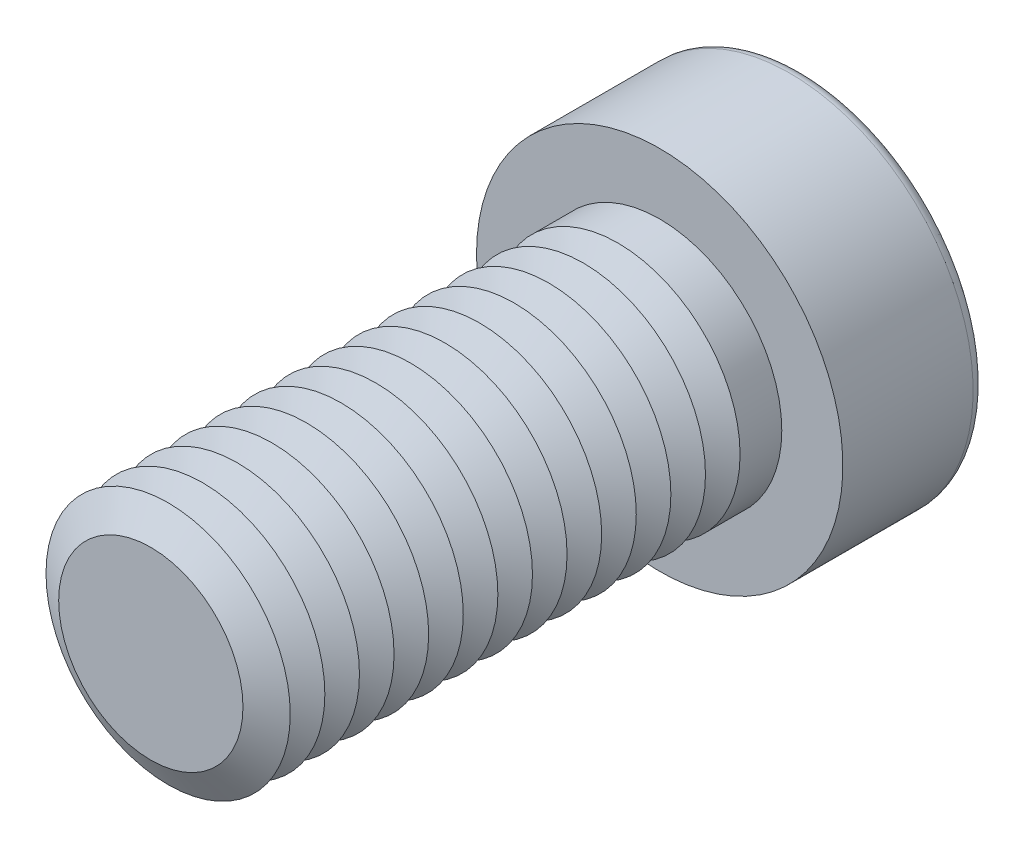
ISO-10303-21;
HEADER;
FILE_DESCRIPTION(('STEP AP214'),'2;1');
FILE_NAME('part.step','',(''),(''),'','','');
FILE_SCHEMA(('AUTOMOTIVE_DESIGN { 1 0 10303 214 1 1 1 1 }'));
ENDSEC;
DATA;
#1=APPLICATION_CONTEXT('core data for automotive mechanical design processes');
#2=APPLICATION_PROTOCOL_DEFINITION('international standard','automotive_design',2000,#1);
#3=PRODUCT_CONTEXT('',#1,'mechanical');
#4=PRODUCT('Part','Part','',(#3));
#5=PRODUCT_RELATED_PRODUCT_CATEGORY('part','',(#4));
#6=PRODUCT_DEFINITION_FORMATION('','',#4);
#7=PRODUCT_DEFINITION_CONTEXT('part definition',#1,'design');
#8=PRODUCT_DEFINITION('design','',#6,#7);
#9=PRODUCT_DEFINITION_SHAPE('','',#8);
#10=(LENGTH_UNIT() NAMED_UNIT(*) SI_UNIT(.MILLI.,.METRE.));
#11=(NAMED_UNIT(*) PLANE_ANGLE_UNIT() SI_UNIT($,.RADIAN.));
#12=(NAMED_UNIT(*) SI_UNIT($,.STERADIAN.) SOLID_ANGLE_UNIT());
#13=UNCERTAINTY_MEASURE_WITH_UNIT(LENGTH_MEASURE(1.E-05),#10,'distance_accuracy_value','');
#14=(GEOMETRIC_REPRESENTATION_CONTEXT(3) GLOBAL_UNCERTAINTY_ASSIGNED_CONTEXT((#13)) GLOBAL_UNIT_ASSIGNED_CONTEXT((#10,
#11,#12)) REPRESENTATION_CONTEXT('',''));
#15=CARTESIAN_POINT('',(0.,0.,0.));
#16=DIRECTION('',(0.,0.,1.));
#17=DIRECTION('',(1.,0.,0.));
#18=AXIS2_PLACEMENT_3D('',#15,#16,#17);
#19=CARTESIAN_POINT('',(0.,0.,19.05));
#20=DIRECTION('',(0.,0.,1.));
#21=DIRECTION('',(1.,0.,0.));
#22=AXIS2_PLACEMENT_3D('',#19,#20,#21);
#23=CONICAL_SURFACE('',#22,6.,1.0471975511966);
#24=CARTESIAN_POINT('',(0.,0.,18.2));
#25=DIRECTION('',(0.,0.,1.));
#26=DIRECTION('',(1.,0.,0.));
#27=AXIS2_PLACEMENT_3D('',#24,#25,#26);
#28=CIRCLE('',#27,4.52775681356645);
#29=CARTESIAN_POINT('',(4.52775681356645,0.,18.2));
#30=VERTEX_POINT('',#29);
#31=EDGE_CURVE('E312',#30,#30,#28,.T.);
#32=ORIENTED_EDGE('',*,*,#31,.T.);
#33=EDGE_LOOP('',(#32));
#34=FACE_BOUND('',#33,.T.);
#35=CARTESIAN_POINT('',(0.,0.,19.05));
#36=DIRECTION('',(0.,0.,1.));
#37=DIRECTION('',(1.,0.,0.));
#38=AXIS2_PLACEMENT_3D('',#35,#36,#37);
#39=CIRCLE('',#38,6.);
#40=CARTESIAN_POINT('',(6.,0.,19.05));
#41=VERTEX_POINT('',#40);
#42=EDGE_CURVE('E315',#41,#41,#39,.T.);
#43=ORIENTED_EDGE('',*,*,#42,.F.);
#44=EDGE_LOOP('',(#43));
#45=FACE_BOUND('',#44,.T.);
#46=ADVANCED_FACE('F39',(#34,#45),#23,.T.);
#47=CARTESIAN_POINT('',(0.,0.,18.2));
#48=DIRECTION('',(0.,0.,-1.));
#49=DIRECTION('',(-1.,0.,0.));
#50=AXIS2_PLACEMENT_3D('',#47,#48,#49);
#51=CONICAL_SURFACE('',#50,4.52775681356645,1.0471975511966);
#52=CARTESIAN_POINT('',(0.,0.,17.35));
#53=DIRECTION('',(0.,0.,1.));
#54=DIRECTION('',(1.,0.,0.));
#55=AXIS2_PLACEMENT_3D('',#52,#53,#54);
#56=CIRCLE('',#55,6.);
#57=CARTESIAN_POINT('',(6.,0.,17.35));
#58=VERTEX_POINT('',#57);
#59=EDGE_CURVE('E323',#58,#58,#56,.T.);
#60=ORIENTED_EDGE('',*,*,#59,.T.);
#61=EDGE_LOOP('',(#60));
#62=FACE_BOUND('',#61,.T.);
#63=ORIENTED_EDGE('',*,*,#31,.F.);
#64=EDGE_LOOP('',(#63));
#65=FACE_BOUND('',#64,.T.);
#66=ADVANCED_FACE('F244',(#62,#65),#51,.T.);
#67=CARTESIAN_POINT('',(0.,0.,25.));
#68=DIRECTION('',(0.,0.,1.));
#69=DIRECTION('',(1.,0.,0.));
#70=AXIS2_PLACEMENT_3D('',#67,#68,#69);
#71=PLANE('',#70);
#72=CARTESIAN_POINT('',(0.,0.,25.));
#73=DIRECTION('',(0.,0.,1.));
#74=DIRECTION('',(1.,0.,0.));
#75=AXIS2_PLACEMENT_3D('',#72,#73,#74);
#76=CIRCLE('',#75,4.52775681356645);
#77=CARTESIAN_POINT('',(4.52775681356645,0.,25.));
#78=VERTEX_POINT('',#77);
#79=EDGE_CURVE('E173',#78,#78,#76,.T.);
#80=ORIENTED_EDGE('',*,*,#79,.T.);
#81=EDGE_LOOP('',(#80));
#82=FACE_BOUND('',#81,.T.);
#83=ADVANCED_FACE('F250',(#82),#71,.T.);
#84=CARTESIAN_POINT('',(0.,0.,25.));
#85=DIRECTION('',(0.,0.,-1.));
#86=DIRECTION('',(-1.,0.,0.));
#87=AXIS2_PLACEMENT_3D('',#84,#85,#86);
#88=CONICAL_SURFACE('',#87,4.52775681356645,1.0471975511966);
#89=CARTESIAN_POINT('',(0.,0.,24.15));
#90=DIRECTION('',(0.,0.,1.));
#91=DIRECTION('',(1.,0.,0.));
#92=AXIS2_PLACEMENT_3D('',#89,#90,#91);
#93=CIRCLE('',#92,6.);
#94=CARTESIAN_POINT('',(6.,0.,24.15));
#95=VERTEX_POINT('',#94);
#96=EDGE_CURVE('E290',#95,#95,#93,.T.);
#97=ORIENTED_EDGE('',*,*,#96,.T.);
#98=EDGE_LOOP('',(#97));
#99=FACE_BOUND('',#98,.T.);
#100=ORIENTED_EDGE('',*,*,#79,.F.);
#101=EDGE_LOOP('',(#100));
#102=FACE_BOUND('',#101,.T.);
#103=ADVANCED_FACE('F198',(#99,#102),#88,.T.);
#104=CARTESIAN_POINT('',(0.,0.,24.15));
#105=DIRECTION('',(0.,0.,1.));
#106=DIRECTION('',(1.,0.,0.));
#107=AXIS2_PLACEMENT_3D('',#104,#105,#106);
#108=CONICAL_SURFACE('',#107,6.,1.0471975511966);
#109=CARTESIAN_POINT('',(0.,0.,23.3));
#110=DIRECTION('',(0.,0.,1.));
#111=DIRECTION('',(1.,0.,0.));
#112=AXIS2_PLACEMENT_3D('',#109,#110,#111);
#113=CIRCLE('',#112,4.52775681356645);
#114=CARTESIAN_POINT('',(4.52775681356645,0.,23.3));
#115=VERTEX_POINT('',#114);
#116=EDGE_CURVE('E287',#115,#115,#113,.T.);
#117=ORIENTED_EDGE('',*,*,#116,.T.);
#118=EDGE_LOOP('',(#117));
#119=FACE_BOUND('',#118,.T.);
#120=ORIENTED_EDGE('',*,*,#96,.F.);
#121=EDGE_LOOP('',(#120));
#122=FACE_BOUND('',#121,.T.);
#123=ADVANCED_FACE('F276',(#119,#122),#108,.T.);
#124=CARTESIAN_POINT('',(0.,0.,23.3));
#125=DIRECTION('',(0.,0.,-1.));
#126=DIRECTION('',(-1.,0.,0.));
#127=AXIS2_PLACEMENT_3D('',#124,#125,#126);
#128=CONICAL_SURFACE('',#127,4.52775681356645,1.0471975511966);
#129=CARTESIAN_POINT('',(0.,0.,22.45));
#130=DIRECTION('',(0.,0.,1.));
#131=DIRECTION('',(1.,0.,0.));
#132=AXIS2_PLACEMENT_3D('',#129,#130,#131);
#133=CIRCLE('',#132,6.);
#134=CARTESIAN_POINT('',(6.,0.,22.45));
#135=VERTEX_POINT('',#134);
#136=EDGE_CURVE('E298',#135,#135,#133,.T.);
#137=ORIENTED_EDGE('',*,*,#136,.T.);
#138=EDGE_LOOP('',(#137));
#139=FACE_BOUND('',#138,.T.);
#140=ORIENTED_EDGE('',*,*,#116,.F.);
#141=EDGE_LOOP('',(#140));
#142=FACE_BOUND('',#141,.T.);
#143=ADVANCED_FACE('F273',(#139,#142),#128,.T.);
#144=CARTESIAN_POINT('',(0.,0.,22.45));
#145=DIRECTION('',(0.,0.,1.));
#146=DIRECTION('',(1.,0.,0.));
#147=AXIS2_PLACEMENT_3D('',#144,#145,#146);
#148=CONICAL_SURFACE('',#147,6.,1.0471975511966);
#149=CARTESIAN_POINT('',(0.,0.,21.6));
#150=DIRECTION('',(0.,0.,1.));
#151=DIRECTION('',(1.,0.,0.));
#152=AXIS2_PLACEMENT_3D('',#149,#150,#151);
#153=CIRCLE('',#152,4.52775681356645);
#154=CARTESIAN_POINT('',(4.52775681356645,0.,21.6));
#155=VERTEX_POINT('',#154);
#156=EDGE_CURVE('E292',#155,#155,#153,.T.);
#157=ORIENTED_EDGE('',*,*,#156,.T.);
#158=EDGE_LOOP('',(#157));
#159=FACE_BOUND('',#158,.T.);
#160=ORIENTED_EDGE('',*,*,#136,.F.);
#161=EDGE_LOOP('',(#160));
#162=FACE_BOUND('',#161,.T.);
#163=ADVANCED_FACE('F269',(#159,#162),#148,.T.);
#164=CARTESIAN_POINT('',(0.,0.,21.6));
#165=DIRECTION('',(0.,0.,-1.));
#166=DIRECTION('',(-1.,0.,0.));
#167=AXIS2_PLACEMENT_3D('',#164,#165,#166);
#168=CONICAL_SURFACE('',#167,4.52775681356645,1.0471975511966);
#169=CARTESIAN_POINT('',(0.,0.,20.75));
#170=DIRECTION('',(0.,0.,1.));
#171=DIRECTION('',(1.,0.,0.));
#172=AXIS2_PLACEMENT_3D('',#169,#170,#171);
#173=CIRCLE('',#172,6.);
#174=CARTESIAN_POINT('',(6.,0.,20.75));
#175=VERTEX_POINT('',#174);
#176=EDGE_CURVE('E308',#175,#175,#173,.T.);
#177=ORIENTED_EDGE('',*,*,#176,.T.);
#178=EDGE_LOOP('',(#177));
#179=FACE_BOUND('',#178,.T.);
#180=ORIENTED_EDGE('',*,*,#156,.F.);
#181=EDGE_LOOP('',(#180));
#182=FACE_BOUND('',#181,.T.);
#183=ADVANCED_FACE('F265',(#179,#182),#168,.T.);
#184=CARTESIAN_POINT('',(0.,0.,20.75));
#185=DIRECTION('',(0.,0.,1.));
#186=DIRECTION('',(1.,0.,0.));
#187=AXIS2_PLACEMENT_3D('',#184,#185,#186);
#188=CONICAL_SURFACE('',#187,6.,1.0471975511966);
#189=CARTESIAN_POINT('',(0.,0.,19.9));
#190=DIRECTION('',(0.,0.,1.));
#191=DIRECTION('',(1.,0.,0.));
#192=AXIS2_PLACEMENT_3D('',#189,#190,#191);
#193=CIRCLE('',#192,4.52775681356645);
#194=CARTESIAN_POINT('',(4.52775681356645,0.,19.9));
#195=VERTEX_POINT('',#194);
#196=EDGE_CURVE('E304',#195,#195,#193,.T.);
#197=ORIENTED_EDGE('',*,*,#196,.T.);
#198=EDGE_LOOP('',(#197));
#199=FACE_BOUND('',#198,.T.);
#200=ORIENTED_EDGE('',*,*,#176,.F.);
#201=EDGE_LOOP('',(#200));
#202=FACE_BOUND('',#201,.T.);
#203=ADVANCED_FACE('F261',(#199,#202),#188,.T.);
#204=CARTESIAN_POINT('',(0.,0.,19.9));
#205=DIRECTION('',(0.,0.,-1.));
#206=DIRECTION('',(-1.,0.,0.));
#207=AXIS2_PLACEMENT_3D('',#204,#205,#206);
#208=CONICAL_SURFACE('',#207,4.52775681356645,1.0471975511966);
#209=ORIENTED_EDGE('',*,*,#42,.T.);
#210=EDGE_LOOP('',(#209));
#211=FACE_BOUND('',#210,.T.);
#212=ORIENTED_EDGE('',*,*,#196,.F.);
#213=EDGE_LOOP('',(#212));
#214=FACE_BOUND('',#213,.T.);
#215=ADVANCED_FACE('F257',(#211,#214),#208,.T.);
#216=CARTESIAN_POINT('',(0.,0.,17.35));
#217=DIRECTION('',(0.,0.,1.));
#218=DIRECTION('',(1.,0.,0.));
#219=AXIS2_PLACEMENT_3D('',#216,#217,#218);
#220=CONICAL_SURFACE('',#219,6.,1.0471975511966);
#221=CARTESIAN_POINT('',(0.,0.,16.5));
#222=DIRECTION('',(0.,0.,1.));
#223=DIRECTION('',(1.,0.,0.));
#224=AXIS2_PLACEMENT_3D('',#221,#222,#223);
#225=CIRCLE('',#224,4.52775681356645);
#226=CARTESIAN_POINT('',(4.52775681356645,0.,16.5));
#227=VERTEX_POINT('',#226);
#228=EDGE_CURVE('E319',#227,#227,#225,.T.);
#229=ORIENTED_EDGE('',*,*,#228,.T.);
#230=EDGE_LOOP('',(#229));
#231=FACE_BOUND('',#230,.T.);
#232=ORIENTED_EDGE('',*,*,#59,.F.);
#233=EDGE_LOOP('',(#232));
#234=FACE_BOUND('',#233,.T.);
#235=ADVANCED_FACE('F260',(#231,#234),#220,.T.);
#236=CARTESIAN_POINT('',(0.,0.,16.5));
#237=DIRECTION('',(0.,0.,-1.));
#238=DIRECTION('',(-1.,0.,0.));
#239=AXIS2_PLACEMENT_3D('',#236,#237,#238);
#240=CONICAL_SURFACE('',#239,4.52775681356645,1.0471975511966);
#241=CARTESIAN_POINT('',(0.,0.,15.65));
#242=DIRECTION('',(0.,0.,1.));
#243=DIRECTION('',(1.,0.,0.));
#244=AXIS2_PLACEMENT_3D('',#241,#242,#243);
#245=CIRCLE('',#244,6.);
#246=CARTESIAN_POINT('',(6.,0.,15.65));
#247=VERTEX_POINT('',#246);
#248=EDGE_CURVE('E330',#247,#247,#245,.T.);
#249=ORIENTED_EDGE('',*,*,#248,.T.);
#250=EDGE_LOOP('',(#249));
#251=FACE_BOUND('',#250,.T.);
#252=ORIENTED_EDGE('',*,*,#228,.F.);
#253=EDGE_LOOP('',(#252));
#254=FACE_BOUND('',#253,.T.);
#255=ADVANCED_FACE('F463',(#251,#254),#240,.T.);
#256=CARTESIAN_POINT('',(0.,0.,15.65));
#257=DIRECTION('',(0.,0.,1.));
#258=DIRECTION('',(1.,0.,0.));
#259=AXIS2_PLACEMENT_3D('',#256,#257,#258);
#260=CONICAL_SURFACE('',#259,6.,1.0471975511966);
#261=CARTESIAN_POINT('',(0.,0.,14.8));
#262=DIRECTION('',(0.,0.,1.));
#263=DIRECTION('',(1.,0.,0.));
#264=AXIS2_PLACEMENT_3D('',#261,#262,#263);
#265=CIRCLE('',#264,4.52775681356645);
#266=CARTESIAN_POINT('',(4.52775681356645,0.,14.8));
#267=VERTEX_POINT('',#266);
#268=EDGE_CURVE('E326',#267,#267,#265,.T.);
#269=ORIENTED_EDGE('',*,*,#268,.T.);
#270=EDGE_LOOP('',(#269));
#271=FACE_BOUND('',#270,.T.);
#272=ORIENTED_EDGE('',*,*,#248,.F.);
#273=EDGE_LOOP('',(#272));
#274=FACE_BOUND('',#273,.T.);
#275=ADVANCED_FACE('F459',(#271,#274),#260,.T.);
#276=CARTESIAN_POINT('',(0.,0.,14.8));
#277=DIRECTION('',(0.,0.,-1.));
#278=DIRECTION('',(-1.,0.,0.));
#279=AXIS2_PLACEMENT_3D('',#276,#277,#278);
#280=CONICAL_SURFACE('',#279,4.52775681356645,1.0471975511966);
#281=CARTESIAN_POINT('',(0.,0.,13.95));
#282=DIRECTION('',(0.,0.,1.));
#283=DIRECTION('',(1.,0.,0.));
#284=AXIS2_PLACEMENT_3D('',#281,#282,#283);
#285=CIRCLE('',#284,6.);
#286=CARTESIAN_POINT('',(6.,0.,13.95));
#287=VERTEX_POINT('',#286);
#288=EDGE_CURVE('E338',#287,#287,#285,.T.);
#289=ORIENTED_EDGE('',*,*,#288,.T.);
#290=EDGE_LOOP('',(#289));
#291=FACE_BOUND('',#290,.T.);
#292=ORIENTED_EDGE('',*,*,#268,.F.);
#293=EDGE_LOOP('',(#292));
#294=FACE_BOUND('',#293,.T.);
#295=ADVANCED_FACE('F455',(#291,#294),#280,.T.);
#296=CARTESIAN_POINT('',(0.,0.,13.95));
#297=DIRECTION('',(0.,0.,1.));
#298=DIRECTION('',(1.,0.,0.));
#299=AXIS2_PLACEMENT_3D('',#296,#297,#298);
#300=CONICAL_SURFACE('',#299,6.,1.0471975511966);
#301=CARTESIAN_POINT('',(0.,0.,13.1));
#302=DIRECTION('',(0.,0.,1.));
#303=DIRECTION('',(1.,0.,0.));
#304=AXIS2_PLACEMENT_3D('',#301,#302,#303);
#305=CIRCLE('',#304,4.52775681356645);
#306=CARTESIAN_POINT('',(4.52775681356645,0.,13.1));
#307=VERTEX_POINT('',#306);
#308=EDGE_CURVE('E334',#307,#307,#305,.T.);
#309=ORIENTED_EDGE('',*,*,#308,.T.);
#310=EDGE_LOOP('',(#309));
#311=FACE_BOUND('',#310,.T.);
#312=ORIENTED_EDGE('',*,*,#288,.F.);
#313=EDGE_LOOP('',(#312));
#314=FACE_BOUND('',#313,.T.);
#315=ADVANCED_FACE('F451',(#311,#314),#300,.T.);
#316=CARTESIAN_POINT('',(0.,0.,13.1));
#317=DIRECTION('',(0.,0.,-1.));
#318=DIRECTION('',(-1.,0.,0.));
#319=AXIS2_PLACEMENT_3D('',#316,#317,#318);
#320=CONICAL_SURFACE('',#319,4.52775681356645,1.0471975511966);
#321=CARTESIAN_POINT('',(0.,0.,12.25));
#322=DIRECTION('',(0.,0.,1.));
#323=DIRECTION('',(1.,0.,0.));
#324=AXIS2_PLACEMENT_3D('',#321,#322,#323);
#325=CIRCLE('',#324,6.);
#326=CARTESIAN_POINT('',(6.,0.,12.25));
#327=VERTEX_POINT('',#326);
#328=EDGE_CURVE('E346',#327,#327,#325,.T.);
#329=ORIENTED_EDGE('',*,*,#328,.T.);
#330=EDGE_LOOP('',(#329));
#331=FACE_BOUND('',#330,.T.);
#332=ORIENTED_EDGE('',*,*,#308,.F.);
#333=EDGE_LOOP('',(#332));
#334=FACE_BOUND('',#333,.T.);
#335=ADVANCED_FACE('F447',(#331,#334),#320,.T.);
#336=CARTESIAN_POINT('',(0.,0.,12.25));
#337=DIRECTION('',(0.,0.,1.));
#338=DIRECTION('',(1.,0.,0.));
#339=AXIS2_PLACEMENT_3D('',#336,#337,#338);
#340=CONICAL_SURFACE('',#339,6.,1.0471975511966);
#341=CARTESIAN_POINT('',(0.,0.,11.4));
#342=DIRECTION('',(0.,0.,1.));
#343=DIRECTION('',(1.,0.,0.));
#344=AXIS2_PLACEMENT_3D('',#341,#342,#343);
#345=CIRCLE('',#344,4.52775681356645);
#346=CARTESIAN_POINT('',(4.52775681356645,0.,11.4));
#347=VERTEX_POINT('',#346);
#348=EDGE_CURVE('E342',#347,#347,#345,.T.);
#349=ORIENTED_EDGE('',*,*,#348,.T.);
#350=EDGE_LOOP('',(#349));
#351=FACE_BOUND('',#350,.T.);
#352=ORIENTED_EDGE('',*,*,#328,.F.);
#353=EDGE_LOOP('',(#352));
#354=FACE_BOUND('',#353,.T.);
#355=ADVANCED_FACE('F443',(#351,#354),#340,.T.);
#356=CARTESIAN_POINT('',(0.,0.,11.4));
#357=DIRECTION('',(0.,0.,-1.));
#358=DIRECTION('',(-1.,0.,0.));
#359=AXIS2_PLACEMENT_3D('',#356,#357,#358);
#360=CONICAL_SURFACE('',#359,4.52775681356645,1.0471975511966);
#361=CARTESIAN_POINT('',(0.,0.,10.55));
#362=DIRECTION('',(0.,0.,1.));
#363=DIRECTION('',(1.,0.,0.));
#364=AXIS2_PLACEMENT_3D('',#361,#362,#363);
#365=CIRCLE('',#364,6.);
#366=CARTESIAN_POINT('',(6.,0.,10.55));
#367=VERTEX_POINT('',#366);
#368=EDGE_CURVE('E354',#367,#367,#365,.T.);
#369=ORIENTED_EDGE('',*,*,#368,.T.);
#370=EDGE_LOOP('',(#369));
#371=FACE_BOUND('',#370,.T.);
#372=ORIENTED_EDGE('',*,*,#348,.F.);
#373=EDGE_LOOP('',(#372));
#374=FACE_BOUND('',#373,.T.);
#375=ADVANCED_FACE('F439',(#371,#374),#360,.T.);
#376=CARTESIAN_POINT('',(0.,0.,10.55));
#377=DIRECTION('',(0.,0.,1.));
#378=DIRECTION('',(1.,0.,0.));
#379=AXIS2_PLACEMENT_3D('',#376,#377,#378);
#380=CONICAL_SURFACE('',#379,6.,1.0471975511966);
#381=CARTESIAN_POINT('',(0.,0.,9.7));
#382=DIRECTION('',(0.,0.,1.));
#383=DIRECTION('',(1.,0.,0.));
#384=AXIS2_PLACEMENT_3D('',#381,#382,#383);
#385=CIRCLE('',#384,4.52775681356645);
#386=CARTESIAN_POINT('',(4.52775681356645,0.,9.7));
#387=VERTEX_POINT('',#386);
#388=EDGE_CURVE('E350',#387,#387,#385,.T.);
#389=ORIENTED_EDGE('',*,*,#388,.T.);
#390=EDGE_LOOP('',(#389));
#391=FACE_BOUND('',#390,.T.);
#392=ORIENTED_EDGE('',*,*,#368,.F.);
#393=EDGE_LOOP('',(#392));
#394=FACE_BOUND('',#393,.T.);
#395=ADVANCED_FACE('F435',(#391,#394),#380,.T.);
#396=CARTESIAN_POINT('',(0.,0.,9.7));
#397=DIRECTION('',(0.,0.,-1.));
#398=DIRECTION('',(-1.,0.,0.));
#399=AXIS2_PLACEMENT_3D('',#396,#397,#398);
#400=CONICAL_SURFACE('',#399,4.52775681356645,1.0471975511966);
#401=CARTESIAN_POINT('',(0.,0.,8.85));
#402=DIRECTION('',(0.,0.,1.));
#403=DIRECTION('',(1.,0.,0.));
#404=AXIS2_PLACEMENT_3D('',#401,#402,#403);
#405=CIRCLE('',#404,6.);
#406=CARTESIAN_POINT('',(6.,0.,8.85));
#407=VERTEX_POINT('',#406);
#408=EDGE_CURVE('E362',#407,#407,#405,.T.);
#409=ORIENTED_EDGE('',*,*,#408,.T.);
#410=EDGE_LOOP('',(#409));
#411=FACE_BOUND('',#410,.T.);
#412=ORIENTED_EDGE('',*,*,#388,.F.);
#413=EDGE_LOOP('',(#412));
#414=FACE_BOUND('',#413,.T.);
#415=ADVANCED_FACE('F431',(#411,#414),#400,.T.);
#416=CARTESIAN_POINT('',(0.,0.,8.85));
#417=DIRECTION('',(0.,0.,1.));
#418=DIRECTION('',(1.,0.,0.));
#419=AXIS2_PLACEMENT_3D('',#416,#417,#418);
#420=CONICAL_SURFACE('',#419,6.,1.0471975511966);
#421=CARTESIAN_POINT('',(0.,0.,8.));
#422=DIRECTION('',(0.,0.,1.));
#423=DIRECTION('',(1.,0.,0.));
#424=AXIS2_PLACEMENT_3D('',#421,#422,#423);
#425=CIRCLE('',#424,4.52775681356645);
#426=CARTESIAN_POINT('',(4.52775681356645,0.,8.));
#427=VERTEX_POINT('',#426);
#428=EDGE_CURVE('E358',#427,#427,#425,.T.);
#429=ORIENTED_EDGE('',*,*,#428,.T.);
#430=EDGE_LOOP('',(#429));
#431=FACE_BOUND('',#430,.T.);
#432=ORIENTED_EDGE('',*,*,#408,.F.);
#433=EDGE_LOOP('',(#432));
#434=FACE_BOUND('',#433,.T.);
#435=ADVANCED_FACE('F427',(#431,#434),#420,.T.);
#436=CARTESIAN_POINT('',(0.,0.,8.));
#437=DIRECTION('',(0.,0.,-1.));
#438=DIRECTION('',(-1.,0.,0.));
#439=AXIS2_PLACEMENT_3D('',#436,#437,#438);
#440=CONICAL_SURFACE('',#439,4.52775681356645,1.0471975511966);
#441=CARTESIAN_POINT('',(0.,0.,7.15));
#442=DIRECTION('',(0.,0.,1.));
#443=DIRECTION('',(1.,0.,0.));
#444=AXIS2_PLACEMENT_3D('',#441,#442,#443);
#445=CIRCLE('',#444,6.);
#446=CARTESIAN_POINT('',(6.,0.,7.15));
#447=VERTEX_POINT('',#446);
#448=EDGE_CURVE('E370',#447,#447,#445,.T.);
#449=ORIENTED_EDGE('',*,*,#448,.T.);
#450=EDGE_LOOP('',(#449));
#451=FACE_BOUND('',#450,.T.);
#452=ORIENTED_EDGE('',*,*,#428,.F.);
#453=EDGE_LOOP('',(#452));
#454=FACE_BOUND('',#453,.T.);
#455=ADVANCED_FACE('F423',(#451,#454),#440,.T.);
#456=CARTESIAN_POINT('',(0.,0.,7.15));
#457=DIRECTION('',(0.,0.,1.));
#458=DIRECTION('',(1.,0.,0.));
#459=AXIS2_PLACEMENT_3D('',#456,#457,#458);
#460=CONICAL_SURFACE('',#459,6.,1.0471975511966);
#461=CARTESIAN_POINT('',(0.,0.,6.3));
#462=DIRECTION('',(0.,0.,1.));
#463=DIRECTION('',(1.,0.,0.));
#464=AXIS2_PLACEMENT_3D('',#461,#462,#463);
#465=CIRCLE('',#464,4.52775681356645);
#466=CARTESIAN_POINT('',(4.52775681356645,0.,6.3));
#467=VERTEX_POINT('',#466);
#468=EDGE_CURVE('E366',#467,#467,#465,.T.);
#469=ORIENTED_EDGE('',*,*,#468,.T.);
#470=EDGE_LOOP('',(#469));
#471=FACE_BOUND('',#470,.T.);
#472=ORIENTED_EDGE('',*,*,#448,.F.);
#473=EDGE_LOOP('',(#472));
#474=FACE_BOUND('',#473,.T.);
#475=ADVANCED_FACE('F419',(#471,#474),#460,.T.);
#476=CARTESIAN_POINT('',(0.,0.,6.3));
#477=DIRECTION('',(0.,0.,-1.));
#478=DIRECTION('',(-1.,0.,0.));
#479=AXIS2_PLACEMENT_3D('',#476,#477,#478);
#480=CONICAL_SURFACE('',#479,4.52775681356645,1.0471975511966);
#481=CARTESIAN_POINT('',(0.,0.,5.45));
#482=DIRECTION('',(0.,0.,1.));
#483=DIRECTION('',(1.,0.,0.));
#484=AXIS2_PLACEMENT_3D('',#481,#482,#483);
#485=CIRCLE('',#484,6.);
#486=CARTESIAN_POINT('',(6.,0.,5.45));
#487=VERTEX_POINT('',#486);
#488=EDGE_CURVE('E378',#487,#487,#485,.T.);
#489=ORIENTED_EDGE('',*,*,#488,.T.);
#490=EDGE_LOOP('',(#489));
#491=FACE_BOUND('',#490,.T.);
#492=ORIENTED_EDGE('',*,*,#468,.F.);
#493=EDGE_LOOP('',(#492));
#494=FACE_BOUND('',#493,.T.);
#495=ADVANCED_FACE('F415',(#491,#494),#480,.T.);
#496=CARTESIAN_POINT('',(0.,0.,5.45));
#497=DIRECTION('',(0.,0.,1.));
#498=DIRECTION('',(1.,0.,0.));
#499=AXIS2_PLACEMENT_3D('',#496,#497,#498);
#500=CONICAL_SURFACE('',#499,6.,1.0471975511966);
#501=CARTESIAN_POINT('',(0.,0.,4.6));
#502=DIRECTION('',(0.,0.,1.));
#503=DIRECTION('',(1.,0.,0.));
#504=AXIS2_PLACEMENT_3D('',#501,#502,#503);
#505=CIRCLE('',#504,4.52775681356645);
#506=CARTESIAN_POINT('',(4.52775681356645,0.,4.6));
#507=VERTEX_POINT('',#506);
#508=EDGE_CURVE('E374',#507,#507,#505,.T.);
#509=ORIENTED_EDGE('',*,*,#508,.T.);
#510=EDGE_LOOP('',(#509));
#511=FACE_BOUND('',#510,.T.);
#512=ORIENTED_EDGE('',*,*,#488,.F.);
#513=EDGE_LOOP('',(#512));
#514=FACE_BOUND('',#513,.T.);
#515=ADVANCED_FACE('F410',(#511,#514),#500,.T.);
#516=CARTESIAN_POINT('',(0.,0.,4.6));
#517=DIRECTION('',(0.,0.,-1.));
#518=DIRECTION('',(-1.,0.,0.));
#519=AXIS2_PLACEMENT_3D('',#516,#517,#518);
#520=CONICAL_SURFACE('',#519,4.52775681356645,1.0471975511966);
#521=CARTESIAN_POINT('',(0.,0.,3.75));
#522=DIRECTION('',(0.,0.,1.));
#523=DIRECTION('',(1.,0.,0.));
#524=AXIS2_PLACEMENT_3D('',#521,#522,#523);
#525=CIRCLE('',#524,6.);
#526=CARTESIAN_POINT('',(6.,0.,3.75));
#527=VERTEX_POINT('',#526);
#528=EDGE_CURVE('E390',#527,#527,#525,.T.);
#529=ORIENTED_EDGE('',*,*,#528,.T.);
#530=EDGE_LOOP('',(#529));
#531=FACE_BOUND('',#530,.T.);
#532=ORIENTED_EDGE('',*,*,#508,.F.);
#533=EDGE_LOOP('',(#532));
#534=FACE_BOUND('',#533,.T.);
#535=ADVANCED_FACE('F396',(#531,#534),#520,.T.);
#536=CARTESIAN_POINT('',(0.,0.,3.75));
#537=DIRECTION('',(0.,0.,1.));
#538=DIRECTION('',(1.,0.,0.));
#539=AXIS2_PLACEMENT_3D('',#536,#537,#538);
#540=CONICAL_SURFACE('',#539,6.,1.0471975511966);
#541=CARTESIAN_POINT('',(0.,0.,2.9));
#542=DIRECTION('',(0.,0.,1.));
#543=DIRECTION('',(1.,0.,0.));
#544=AXIS2_PLACEMENT_3D('',#541,#542,#543);
#545=CIRCLE('',#544,4.52775681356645);
#546=CARTESIAN_POINT('',(4.52775681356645,0.,2.9));
#547=VERTEX_POINT('',#546);
#548=EDGE_CURVE('E382',#547,#547,#545,.T.);
#549=ORIENTED_EDGE('',*,*,#548,.T.);
#550=EDGE_LOOP('',(#549));
#551=FACE_BOUND('',#550,.T.);
#552=ORIENTED_EDGE('',*,*,#528,.F.);
#553=EDGE_LOOP('',(#552));
#554=FACE_BOUND('',#553,.T.);
#555=ADVANCED_FACE('F399',(#551,#554),#540,.T.);
#556=CARTESIAN_POINT('',(0.,0.,2.9));
#557=DIRECTION('',(0.,0.,-1.));
#558=DIRECTION('',(-1.,0.,0.));
#559=AXIS2_PLACEMENT_3D('',#556,#557,#558);
#560=CONICAL_SURFACE('',#559,4.52775681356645,1.0471975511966);
#561=CARTESIAN_POINT('',(0.,0.,2.05));
#562=DIRECTION('',(0.,0.,1.));
#563=DIRECTION('',(1.,0.,0.));
#564=AXIS2_PLACEMENT_3D('',#561,#562,#563);
#565=CIRCLE('',#564,6.);
#566=CARTESIAN_POINT('',(6.,0.,2.05));
#567=VERTEX_POINT('',#566);
#568=EDGE_CURVE('E386',#567,#567,#565,.T.);
#569=ORIENTED_EDGE('',*,*,#568,.T.);
#570=EDGE_LOOP('',(#569));
#571=FACE_BOUND('',#570,.T.);
#572=ORIENTED_EDGE('',*,*,#548,.F.);
#573=EDGE_LOOP('',(#572));
#574=FACE_BOUND('',#573,.T.);
#575=ADVANCED_FACE('F401',(#571,#574),#560,.T.);
#576=CARTESIAN_POINT('',(0.,0.,-1.));
#577=DIRECTION('',(0.,0.,-1.));
#578=DIRECTION('',(-1.,0.,0.));
#579=AXIS2_PLACEMENT_3D('',#576,#577,#578);
#580=CONICAL_SURFACE('',#579,4.,1.0471975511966);
#581=CARTESIAN_POINT('',(0.,0.,1.30940107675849));
#582=VERTEX_POINT('',#581);
#583=VERTEX_LOOP('',#582);
#584=FACE_BOUND('',#583,.T.);
#585=CARTESIAN_POINT('',(0.,0.,-1.));
#586=DIRECTION('',(0.,0.,-1.));
#587=DIRECTION('',(-1.,0.,0.));
#588=AXIS2_PLACEMENT_3D('',#585,#586,#587);
#589=CIRCLE('',#588,4.);
#590=CARTESIAN_POINT('',(-3.46410161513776,2.,-1.));
#591=VERTEX_POINT('',#590);
#592=CARTESIAN_POINT('',(0.,4.,-1.));
#593=VERTEX_POINT('',#592);
#594=EDGE_CURVE('E149',#591,#593,#589,.T.);
#595=ORIENTED_EDGE('',*,*,#594,.T.);
#596=CARTESIAN_POINT('',(0.,0.,-1.));
#597=DIRECTION('',(0.,0.,-1.));
#598=DIRECTION('',(-1.,0.,0.));
#599=AXIS2_PLACEMENT_3D('',#596,#597,#598);
#600=CIRCLE('',#599,4.);
#601=CARTESIAN_POINT('',(3.46410161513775,2.,-1.));
#602=VERTEX_POINT('',#601);
#603=EDGE_CURVE('E54',#593,#602,#600,.T.);
#604=ORIENTED_EDGE('',*,*,#603,.T.);
#605=CARTESIAN_POINT('',(3.46410161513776,-2.,-1.));
#606=VERTEX_POINT('',#605);
#607=EDGE_CURVE('E936',#602,#606,#600,.T.);
#608=ORIENTED_EDGE('',*,*,#607,.T.);
#609=CARTESIAN_POINT('',(0.,-4.,-1.));
#610=VERTEX_POINT('',#609);
#611=EDGE_CURVE('E934',#606,#610,#600,.T.);
#612=ORIENTED_EDGE('',*,*,#611,.T.);
#613=CARTESIAN_POINT('',(-3.46410161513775,-2.,-1.));
#614=VERTEX_POINT('',#613);
#615=EDGE_CURVE('E929',#610,#614,#600,.T.);
#616=ORIENTED_EDGE('',*,*,#615,.T.);
#617=EDGE_CURVE('E927',#614,#591,#600,.T.);
#618=ORIENTED_EDGE('',*,*,#617,.T.);
#619=EDGE_LOOP('',(#595,#604,#608,#612,#616,#618));
#620=FACE_BOUND('',#619,.T.);
#621=ADVANCED_FACE('F200',(#584,#620),#580,.F.);
#622=CARTESIAN_POINT('',(0.,0.,-1.));
#623=DIRECTION('',(0.,0.,-1.));
#624=DIRECTION('',(-1.,0.,0.));
#625=AXIS2_PLACEMENT_3D('',#622,#623,#624);
#626=PLANE('',#625);
#627=ORIENTED_EDGE('',*,*,#603,.F.);
#628=DIRECTION('',(1.,0.,0.));
#629=VECTOR('',#628,1.);
#630=CARTESIAN_POINT('',(-2.3094010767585,4.,-1.));
#631=LINE('',#630,#629);
#632=CARTESIAN_POINT('',(2.3094010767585,4.,-1.));
#633=VERTEX_POINT('',#632);
#634=EDGE_CURVE('E975',#593,#633,#631,.T.);
#635=ORIENTED_EDGE('',*,*,#634,.T.);
#636=DIRECTION('',(0.5,-0.866025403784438,0.));
#637=VECTOR('',#636,1.);
#638=CARTESIAN_POINT('',(2.3094010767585,4.,-1.));
#639=LINE('',#638,#637);
#640=EDGE_CURVE('E155',#633,#602,#639,.T.);
#641=ORIENTED_EDGE('',*,*,#640,.T.);
#642=EDGE_LOOP('',(#627,#635,#641));
#643=FACE_BOUND('',#642,.T.);
#644=ADVANCED_FACE('F540',(#643),#626,.T.);
#645=ORIENTED_EDGE('',*,*,#607,.F.);
#646=CARTESIAN_POINT('',(4.61880215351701,0.,-1.));
#647=VERTEX_POINT('',#646);
#648=EDGE_CURVE('E971',#602,#647,#639,.T.);
#649=ORIENTED_EDGE('',*,*,#648,.T.);
#650=DIRECTION('',(-0.5,-0.866025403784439,0.));
#651=VECTOR('',#650,1.);
#652=CARTESIAN_POINT('',(4.61880215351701,0.,-1.));
#653=LINE('',#652,#651);
#654=EDGE_CURVE('E950',#647,#606,#653,.T.);
#655=ORIENTED_EDGE('',*,*,#654,.T.);
#656=EDGE_LOOP('',(#645,#649,#655));
#657=FACE_BOUND('',#656,.T.);
#658=ADVANCED_FACE('F550',(#657),#626,.T.);
#659=ORIENTED_EDGE('',*,*,#611,.F.);
#660=CARTESIAN_POINT('',(2.3094010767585,-4.,-1.));
#661=VERTEX_POINT('',#660);
#662=EDGE_CURVE('E952',#606,#661,#653,.T.);
#663=ORIENTED_EDGE('',*,*,#662,.T.);
#664=DIRECTION('',(-1.,0.,0.));
#665=VECTOR('',#664,1.);
#666=CARTESIAN_POINT('',(2.3094010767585,-4.,-1.));
#667=LINE('',#666,#665);
#668=EDGE_CURVE('E901',#661,#610,#667,.T.);
#669=ORIENTED_EDGE('',*,*,#668,.T.);
#670=EDGE_LOOP('',(#659,#663,#669));
#671=FACE_BOUND('',#670,.T.);
#672=ADVANCED_FACE('F560',(#671),#626,.T.);
#673=ORIENTED_EDGE('',*,*,#615,.F.);
#674=CARTESIAN_POINT('',(-2.3094010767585,-4.,-1.));
#675=VERTEX_POINT('',#674);
#676=EDGE_CURVE('E946',#610,#675,#667,.T.);
#677=ORIENTED_EDGE('',*,*,#676,.T.);
#678=DIRECTION('',(-0.5,0.866025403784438,0.));
#679=VECTOR('',#678,1.);
#680=CARTESIAN_POINT('',(-2.3094010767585,-4.,-1.));
#681=LINE('',#680,#679);
#682=EDGE_CURVE('E948',#675,#614,#681,.T.);
#683=ORIENTED_EDGE('',*,*,#682,.T.);
#684=EDGE_LOOP('',(#673,#677,#683));
#685=FACE_BOUND('',#684,.T.);
#686=ADVANCED_FACE('F568',(#685),#626,.T.);
#687=ORIENTED_EDGE('',*,*,#617,.F.);
#688=CARTESIAN_POINT('',(-4.61880215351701,0.,-1.));
#689=VERTEX_POINT('',#688);
#690=EDGE_CURVE('E953',#614,#689,#681,.T.);
#691=ORIENTED_EDGE('',*,*,#690,.T.);
#692=DIRECTION('',(0.5,0.866025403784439,0.));
#693=VECTOR('',#692,1.);
#694=CARTESIAN_POINT('',(-4.61880215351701,0.,-1.));
#695=LINE('',#694,#693);
#696=EDGE_CURVE('E158',#689,#591,#695,.T.);
#697=ORIENTED_EDGE('',*,*,#696,.T.);
#698=EDGE_LOOP('',(#687,#691,#697));
#699=FACE_BOUND('',#698,.T.);
#700=ADVANCED_FACE('F230',(#699),#626,.T.);
#701=ORIENTED_EDGE('',*,*,#594,.F.);
#702=CARTESIAN_POINT('',(-2.3094010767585,4.,-1.));
#703=VERTEX_POINT('',#702);
#704=EDGE_CURVE('E958',#591,#703,#695,.T.);
#705=ORIENTED_EDGE('',*,*,#704,.T.);
#706=EDGE_CURVE('E973',#703,#593,#631,.T.);
#707=ORIENTED_EDGE('',*,*,#706,.T.);
#708=EDGE_LOOP('',(#701,#705,#707));
#709=FACE_BOUND('',#708,.T.);
#710=ADVANCED_FACE('F552',(#709),#626,.T.);
#711=CARTESIAN_POINT('',(-2.3094010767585,4.,-1.));
#712=DIRECTION('',(0.,1.,0.));
#713=DIRECTION('',(0.,0.,1.));
#714=AXIS2_PLACEMENT_3D('',#711,#712,#713);
#715=PLANE('',#714);
#716=DIRECTION('',(0.,0.,-1.));
#717=VECTOR('',#716,1.);
#718=CARTESIAN_POINT('',(-2.3094010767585,4.,-1.));
#719=LINE('',#718,#717);
#720=CARTESIAN_POINT('',(-2.3094010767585,4.,-7.));
#721=VERTEX_POINT('',#720);
#722=EDGE_CURVE('E147',#703,#721,#719,.T.);
#723=ORIENTED_EDGE('',*,*,#722,.T.);
#724=CARTESIAN_POINT('',(-6.02881516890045,4.,-7.70103379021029));
#725=CARTESIAN_POINT('',(-5.8481958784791,4.,-7.66071709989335));
#726=CARTESIAN_POINT('',(-5.66746141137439,4.,-7.62090727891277));
#727=CARTESIAN_POINT('',(-5.30570552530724,4.,-7.54257487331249));
#728=CARTESIAN_POINT('',(-5.12468409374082,4.,-7.50405234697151));
#729=CARTESIAN_POINT('',(-4.76212658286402,4.,-7.42853268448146));
#730=CARTESIAN_POINT('',(-4.58059016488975,4.,-7.39153716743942));
#731=CARTESIAN_POINT('',(-4.21713405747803,4.,-7.31948392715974));
#732=CARTESIAN_POINT('',(-4.03521437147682,4.,-7.28442618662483));
#733=CARTESIAN_POINT('',(-3.67250657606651,4.,-7.21700168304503));
#734=CARTESIAN_POINT('',(-3.4917223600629,4.,-7.18461419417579));
#735=CARTESIAN_POINT('',(-3.12965653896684,4.,-7.12275774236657));
#736=CARTESIAN_POINT('',(-2.94837492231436,4.,-7.09328884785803));
#737=CARTESIAN_POINT('',(-2.40374454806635,4.,-7.01026455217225));
#738=CARTESIAN_POINT('',(-2.03952090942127,4.,-6.96207428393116));
#739=CARTESIAN_POINT('',(-1.48950033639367,4.,-6.90518200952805));
#740=CARTESIAN_POINT('',(-1.30450135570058,4.,-6.88873552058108));
#741=CARTESIAN_POINT('',(-0.934053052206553,4.,-6.86198845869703));
#742=CARTESIAN_POINT('',(-0.748603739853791,4.,-6.85168774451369));
#743=CARTESIAN_POINT('',(-0.377528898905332,4.,-6.83783090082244));
#744=CARTESIAN_POINT('',(-0.191903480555,4.,-6.83427186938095));
#745=CARTESIAN_POINT('',(0.179350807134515,4.,-6.83411569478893));
#746=CARTESIAN_POINT('',(0.364979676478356,4.,-6.83751856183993));
#747=CARTESIAN_POINT('',(0.736742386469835,4.,-6.85109802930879));
#748=CARTESIAN_POINT('',(0.922875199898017,4.,-6.86130219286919));
#749=CARTESIAN_POINT('',(1.29469888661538,4.,-6.8879135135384));
#750=CARTESIAN_POINT('',(1.48038973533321,4.,-6.90432100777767));
#751=CARTESIAN_POINT('',(1.85132520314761,4.,-6.94252995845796));
#752=CARTESIAN_POINT('',(2.036569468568,4.,-6.96433479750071));
#753=CARTESIAN_POINT('',(2.40646407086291,4.,-7.0124559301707));
#754=CARTESIAN_POINT('',(2.59111440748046,4.,-7.03877222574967));
#755=CARTESIAN_POINT('',(2.96467049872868,4.,-7.09583231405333));
#756=CARTESIAN_POINT('',(3.15356118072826,4.,-7.12667393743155));
#757=CARTESIAN_POINT('',(3.53080577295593,4.,-7.19148953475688));
#758=CARTESIAN_POINT('',(3.71915966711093,4.,-7.22546360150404));
#759=CARTESIAN_POINT('',(4.2835627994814,4.,-7.33112271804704));
#760=CARTESIAN_POINT('',(4.65891157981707,4.,-7.40653797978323));
#761=CARTESIAN_POINT('',(5.40835351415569,4.,-7.56376983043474));
#762=CARTESIAN_POINT('',(5.78244627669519,4.,-7.64558825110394));
#763=CARTESIAN_POINT('',(6.52968076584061,4.,-7.81348272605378));
#764=CARTESIAN_POINT('',(6.90282246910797,4.,-7.89955888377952));
#765=CARTESIAN_POINT('',(7.64386653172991,4.,-8.07356157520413));
#766=CARTESIAN_POINT('',(8.01177724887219,4.,-8.16145269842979));
#767=CARTESIAN_POINT('',(8.74711499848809,4.,-8.33926751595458));
#768=CARTESIAN_POINT('',(9.11454201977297,4.,-8.42919125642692));
#769=CARTESIAN_POINT('',(9.84851788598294,4.,-8.61039317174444));
#770=CARTESIAN_POINT('',(10.2150672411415,4.,-8.70166928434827));
#771=CARTESIAN_POINT('',(10.9478692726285,4.,-8.88534974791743));
#772=CARTESIAN_POINT('',(11.3141219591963,4.,-8.97775405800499));
#773=CARTESIAN_POINT('',(11.6802738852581,4.,-9.07055157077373));
#774=B_SPLINE_CURVE_WITH_KNOTS('',3,(#724,#725,#726,#727,#728,#729,#730,#731,#732,#733,#734,
#735,#736,#737,#738,#739,#740,#741,#742,#743,#744,#745,#746,#747,#748,#749,#750,#751,#752,#753,
#754,#755,#756,#757,#758,#759,#760,#761,#762,#763,#764,#765,#766,#767,#768,#769,#770,#771,#772,
#773),.UNSPECIFIED.,.F.,.F.,(4,2,2,2,2,2,2,2,2,2,2,2,2,2,2,2,2,2,2,2,2,2,2,2,4),(0.,
0.555194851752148,1.11041480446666,1.6662090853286,2.22199840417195,2.77296094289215,
3.32393639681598,4.42561440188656,4.98271716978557,5.5398071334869,6.09665724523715,
6.65350817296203,7.2126296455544,7.77178150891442,8.33128469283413,8.89078811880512,
9.46493123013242,10.0390913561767,11.1875388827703,12.3363161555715,13.4851213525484,
14.6199040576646,15.7547125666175,16.8879395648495,18.0211256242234),.UNSPECIFIED.);
#775=CARTESIAN_POINT('',(2.3094010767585,4.,-7.));
#776=VERTEX_POINT('',#775);
#777=EDGE_CURVE('E124',#721,#776,#774,.T.);
#778=ORIENTED_EDGE('',*,*,#777,.T.);
#779=DIRECTION('',(0.,0.,-1.));
#780=VECTOR('',#779,1.);
#781=CARTESIAN_POINT('',(2.3094010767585,4.,-1.));
#782=LINE('',#781,#780);
#783=EDGE_CURVE('E143',#633,#776,#782,.T.);
#784=ORIENTED_EDGE('',*,*,#783,.F.);
#785=ORIENTED_EDGE('',*,*,#634,.F.);
#786=ORIENTED_EDGE('',*,*,#706,.F.);
#787=EDGE_LOOP('',(#723,#778,#784,#785,#786));
#788=FACE_BOUND('',#787,.T.);
#789=ADVANCED_FACE('F141',(#788),#715,.F.);
#790=CARTESIAN_POINT('',(2.3094010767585,4.,-1.));
#791=DIRECTION('',(0.866025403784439,0.5,0.));
#792=DIRECTION('',(-0.5,0.866025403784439,0.));
#793=AXIS2_PLACEMENT_3D('',#790,#791,#792);
#794=PLANE('',#793);
#795=ORIENTED_EDGE('',*,*,#783,.T.);
#796=CARTESIAN_POINT('',(2.30928560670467,4.0002,-7.0000309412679));
#797=CARTESIAN_POINT('',(2.40519879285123,3.83407348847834,-6.97431943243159));
#798=CARTESIAN_POINT('',(2.50128588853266,3.66764575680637,-6.95097756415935));
#799=CARTESIAN_POINT('',(2.69379944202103,3.33420250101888,-6.90996801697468));
#800=CARTESIAN_POINT('',(2.79022602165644,3.16718676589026,-6.89230264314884));
#801=CARTESIAN_POINT('',(2.98283386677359,2.83358019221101,-6.86367744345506));
#802=CARTESIAN_POINT('',(3.07901382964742,2.66699160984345,-6.85268347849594));
#803=CARTESIAN_POINT('',(3.27149641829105,2.33360198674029,-6.83794168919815));
#804=CARTESIAN_POINT('',(3.3677990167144,2.16680099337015,-6.83419246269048));
#805=CARTESIAN_POINT('',(3.56040421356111,1.83319900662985,-6.83419246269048));
#806=CARTESIAN_POINT('',(3.65670681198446,1.66639801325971,-6.83794168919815));
#807=CARTESIAN_POINT('',(3.84918940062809,1.33300839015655,-6.85268347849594));
#808=CARTESIAN_POINT('',(3.94536936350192,1.16641980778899,-6.86367744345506));
#809=CARTESIAN_POINT('',(4.13797720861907,0.832813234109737,-6.89230264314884));
#810=CARTESIAN_POINT('',(4.23440378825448,0.66579749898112,-6.90996801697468));
#811=CARTESIAN_POINT('',(4.42691734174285,0.332354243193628,-6.95097756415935));
#812=CARTESIAN_POINT('',(4.52300443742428,0.165926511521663,-6.97431943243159));
#813=CARTESIAN_POINT('',(4.61891762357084,-0.000199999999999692,-7.0000309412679));
#814=B_SPLINE_CURVE_WITH_KNOTS('',3,(#796,#797,#798,#799,#800,#801,#802,#803,#804,#805,#806,
#807,#808,#809,#810,#811,#812,#813),.UNSPECIFIED.,.F.,.F.,(4,2,2,2,2,2,2,2,4),(0.,
0.580655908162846,1.1615473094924,1.73944052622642,2.31722188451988,2.89500324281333,
3.47289645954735,4.0537878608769,4.63444376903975),.UNSPECIFIED.);
#815=CARTESIAN_POINT('',(4.61880215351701,0.,-7.));
#816=VERTEX_POINT('',#815);
#817=EDGE_CURVE('E11',#776,#816,#814,.T.);
#818=ORIENTED_EDGE('',*,*,#817,.T.);
#819=DIRECTION('',(0.,0.,-1.));
#820=VECTOR('',#819,1.);
#821=CARTESIAN_POINT('',(4.61880215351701,0.,-1.));
#822=LINE('',#821,#820);
#823=EDGE_CURVE('E157',#647,#816,#822,.T.);
#824=ORIENTED_EDGE('',*,*,#823,.F.);
#825=ORIENTED_EDGE('',*,*,#648,.F.);
#826=ORIENTED_EDGE('',*,*,#640,.F.);
#827=EDGE_LOOP('',(#795,#818,#824,#825,#826));
#828=FACE_BOUND('',#827,.T.);
#829=ADVANCED_FACE('F152',(#828),#794,.F.);
#830=CARTESIAN_POINT('',(4.61880215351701,0.,-1.));
#831=DIRECTION('',(0.866025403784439,-0.5,0.));
#832=DIRECTION('',(0.5,0.866025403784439,0.));
#833=AXIS2_PLACEMENT_3D('',#830,#831,#832);
#834=PLANE('',#833);
#835=ORIENTED_EDGE('',*,*,#823,.T.);
#836=CARTESIAN_POINT('',(4.61891762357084,0.00020000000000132,-7.0000309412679));
#837=CARTESIAN_POINT('',(4.52300443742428,-0.165926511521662,-6.97431943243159));
#838=CARTESIAN_POINT('',(4.42691734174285,-0.332354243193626,-6.95097756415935));
#839=CARTESIAN_POINT('',(4.23440378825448,-0.665797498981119,-6.90996801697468));
#840=CARTESIAN_POINT('',(4.13797720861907,-0.832813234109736,-6.89230264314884));
#841=CARTESIAN_POINT('',(3.94536936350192,-1.16641980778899,-6.86367744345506));
#842=CARTESIAN_POINT('',(3.84918940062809,-1.33300839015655,-6.85268347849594));
#843=CARTESIAN_POINT('',(3.65670681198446,-1.66639801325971,-6.83794168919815));
#844=CARTESIAN_POINT('',(3.56040421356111,-1.83319900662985,-6.83419246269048));
#845=CARTESIAN_POINT('',(3.3677990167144,-2.16680099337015,-6.83419246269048));
#846=CARTESIAN_POINT('',(3.27149641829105,-2.33360198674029,-6.83794168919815));
#847=CARTESIAN_POINT('',(3.07901382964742,-2.66699160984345,-6.85268347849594));
#848=CARTESIAN_POINT('',(2.98283386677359,-2.83358019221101,-6.86367744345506));
#849=CARTESIAN_POINT('',(2.79022602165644,-3.16718676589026,-6.89230264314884));
#850=CARTESIAN_POINT('',(2.69379944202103,-3.33420250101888,-6.90996801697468));
#851=CARTESIAN_POINT('',(2.50128588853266,-3.66764575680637,-6.95097756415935));
#852=CARTESIAN_POINT('',(2.40519879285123,-3.83407348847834,-6.97431943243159));
#853=CARTESIAN_POINT('',(2.30928560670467,-4.0002,-7.0000309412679));
#854=B_SPLINE_CURVE_WITH_KNOTS('',3,(#836,#837,#838,#839,#840,#841,#842,#843,#844,#845,#846,
#847,#848,#849,#850,#851,#852,#853),.UNSPECIFIED.,.F.,.F.,(4,2,2,2,2,2,2,2,4),(0.,
0.580655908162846,1.1615473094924,1.73944052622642,2.31722188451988,2.89500324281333,
3.47289645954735,4.0537878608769,4.63444376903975),.UNSPECIFIED.);
#855=CARTESIAN_POINT('',(2.3094010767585,-4.,-7.));
#856=VERTEX_POINT('',#855);
#857=EDGE_CURVE('E172',#816,#856,#854,.T.);
#858=ORIENTED_EDGE('',*,*,#857,.T.);
#859=DIRECTION('',(0.,0.,-1.));
#860=VECTOR('',#859,1.);
#861=CARTESIAN_POINT('',(2.3094010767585,-4.,-1.));
#862=LINE('',#861,#860);
#863=EDGE_CURVE('E896',#661,#856,#862,.T.);
#864=ORIENTED_EDGE('',*,*,#863,.F.);
#865=ORIENTED_EDGE('',*,*,#662,.F.);
#866=ORIENTED_EDGE('',*,*,#654,.F.);
#867=EDGE_LOOP('',(#835,#858,#864,#865,#866));
#868=FACE_BOUND('',#867,.T.);
#869=ADVANCED_FACE('F190',(#868),#834,.F.);
#870=CARTESIAN_POINT('',(2.3094010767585,-4.,-1.));
#871=DIRECTION('',(0.,-1.,0.));
#872=DIRECTION('',(0.,0.,-1.));
#873=AXIS2_PLACEMENT_3D('',#870,#871,#872);
#874=PLANE('',#873);
#875=ORIENTED_EDGE('',*,*,#863,.T.);
#876=CARTESIAN_POINT('',(-6.02881516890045,-4.,-7.70103379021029));
#877=CARTESIAN_POINT('',(-5.8481958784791,-4.,-7.66071709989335));
#878=CARTESIAN_POINT('',(-5.66746141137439,-4.,-7.62090727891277));
#879=CARTESIAN_POINT('',(-5.30570552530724,-4.,-7.54257487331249));
#880=CARTESIAN_POINT('',(-5.12468409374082,-4.,-7.50405234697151));
#881=CARTESIAN_POINT('',(-4.76212658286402,-4.,-7.42853268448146));
#882=CARTESIAN_POINT('',(-4.58059016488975,-4.,-7.39153716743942));
#883=CARTESIAN_POINT('',(-4.21713405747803,-4.,-7.31948392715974));
#884=CARTESIAN_POINT('',(-4.03521437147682,-4.,-7.28442618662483));
#885=CARTESIAN_POINT('',(-3.67250657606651,-4.,-7.21700168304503));
#886=CARTESIAN_POINT('',(-3.49172236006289,-4.,-7.18461419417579));
#887=CARTESIAN_POINT('',(-3.12965653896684,-4.,-7.12275774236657));
#888=CARTESIAN_POINT('',(-2.94837492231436,-4.,-7.09328884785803));
#889=CARTESIAN_POINT('',(-2.40374454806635,-4.,-7.01026455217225));
#890=CARTESIAN_POINT('',(-2.03952090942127,-4.,-6.96207428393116));
#891=CARTESIAN_POINT('',(-1.48950033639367,-4.,-6.90518200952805));
#892=CARTESIAN_POINT('',(-1.30450135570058,-4.,-6.88873552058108));
#893=CARTESIAN_POINT('',(-0.934053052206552,-4.,-6.86198845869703));
#894=CARTESIAN_POINT('',(-0.748603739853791,-4.,-6.85168774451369));
#895=CARTESIAN_POINT('',(-0.377528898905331,-4.,-6.83783090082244));
#896=CARTESIAN_POINT('',(-0.191903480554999,-4.,-6.83427186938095));
#897=CARTESIAN_POINT('',(0.179350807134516,-4.,-6.83411569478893));
#898=CARTESIAN_POINT('',(0.364979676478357,-4.,-6.83751856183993));
#899=CARTESIAN_POINT('',(0.736742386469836,-4.,-6.85109802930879));
#900=CARTESIAN_POINT('',(0.922875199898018,-4.,-6.86130219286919));
#901=CARTESIAN_POINT('',(1.29469888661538,-4.,-6.8879135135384));
#902=CARTESIAN_POINT('',(1.48038973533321,-4.,-6.90432100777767));
#903=CARTESIAN_POINT('',(1.85132520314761,-4.,-6.94252995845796));
#904=CARTESIAN_POINT('',(2.036569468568,-4.,-6.96433479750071));
#905=CARTESIAN_POINT('',(2.40646407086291,-4.,-7.0124559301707));
#906=CARTESIAN_POINT('',(2.59111440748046,-4.,-7.03877222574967));
#907=CARTESIAN_POINT('',(2.96467049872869,-4.,-7.09583231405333));
#908=CARTESIAN_POINT('',(3.15356118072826,-4.,-7.12667393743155));
#909=CARTESIAN_POINT('',(3.53080577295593,-4.,-7.19148953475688));
#910=CARTESIAN_POINT('',(3.71915966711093,-4.,-7.22546360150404));
#911=CARTESIAN_POINT('',(4.2835627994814,-4.,-7.33112271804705));
#912=CARTESIAN_POINT('',(4.65891157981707,-4.,-7.40653797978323));
#913=CARTESIAN_POINT('',(5.40835351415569,-4.,-7.56376983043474));
#914=CARTESIAN_POINT('',(5.78244627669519,-4.,-7.64558825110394));
#915=CARTESIAN_POINT('',(6.52968076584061,-4.,-7.81348272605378));
#916=CARTESIAN_POINT('',(6.90282246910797,-4.,-7.89955888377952));
#917=CARTESIAN_POINT('',(7.64386653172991,-4.,-8.07356157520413));
#918=CARTESIAN_POINT('',(8.01177724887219,-4.,-8.16145269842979));
#919=CARTESIAN_POINT('',(8.74711499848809,-4.,-8.33926751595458));
#920=CARTESIAN_POINT('',(9.11454201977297,-4.,-8.42919125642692));
#921=CARTESIAN_POINT('',(9.84851788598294,-4.,-8.61039317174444));
#922=CARTESIAN_POINT('',(10.2150672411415,-4.,-8.70166928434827));
#923=CARTESIAN_POINT('',(10.9478692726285,-4.,-8.88534974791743));
#924=CARTESIAN_POINT('',(11.3141219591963,-4.,-8.97775405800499));
#925=CARTESIAN_POINT('',(11.6802738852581,-4.,-9.07055157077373));
#926=B_SPLINE_CURVE_WITH_KNOTS('',3,(#876,#877,#878,#879,#880,#881,#882,#883,#884,#885,#886,
#887,#888,#889,#890,#891,#892,#893,#894,#895,#896,#897,#898,#899,#900,#901,#902,#903,#904,#905,
#906,#907,#908,#909,#910,#911,#912,#913,#914,#915,#916,#917,#918,#919,#920,#921,#922,#923,#924,
#925),.UNSPECIFIED.,.F.,.F.,(4,2,2,2,2,2,2,2,2,2,2,2,2,2,2,2,2,2,2,2,2,2,2,2,4),(0.,
0.555194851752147,1.11041480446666,1.6662090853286,2.22199840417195,2.77296094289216,
3.32393639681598,4.42561440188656,4.98271716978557,5.5398071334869,6.09665724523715,
6.65350817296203,7.2126296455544,7.77178150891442,8.33128469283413,8.89078811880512,
9.46493123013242,10.0390913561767,11.1875388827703,12.3363161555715,13.4851213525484,
14.6199040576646,15.7547125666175,16.8879395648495,18.0211256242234),.UNSPECIFIED.);
#927=CARTESIAN_POINT('',(-2.3094010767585,-4.,-7.));
#928=VERTEX_POINT('',#927);
#929=EDGE_CURVE('E183',#856,#928,#926,.F.);
#930=ORIENTED_EDGE('',*,*,#929,.T.);
#931=DIRECTION('',(0.,0.,-1.));
#932=VECTOR('',#931,1.);
#933=CARTESIAN_POINT('',(-2.3094010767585,-4.,-1.));
#934=LINE('',#933,#932);
#935=EDGE_CURVE('E903',#675,#928,#934,.T.);
#936=ORIENTED_EDGE('',*,*,#935,.F.);
#937=ORIENTED_EDGE('',*,*,#676,.F.);
#938=ORIENTED_EDGE('',*,*,#668,.F.);
#939=EDGE_LOOP('',(#875,#930,#936,#937,#938));
#940=FACE_BOUND('',#939,.T.);
#941=ADVANCED_FACE('F233',(#940),#874,.F.);
#942=CARTESIAN_POINT('',(-2.3094010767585,-4.,-1.));
#943=DIRECTION('',(-0.866025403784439,-0.5,0.));
#944=DIRECTION('',(0.5,-0.866025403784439,0.));
#945=AXIS2_PLACEMENT_3D('',#942,#943,#944);
#946=PLANE('',#945);
#947=ORIENTED_EDGE('',*,*,#935,.T.);
#948=CARTESIAN_POINT('',(-2.30928560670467,-4.0002,-7.0000309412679));
#949=CARTESIAN_POINT('',(-2.40519879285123,-3.83407348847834,-6.97431943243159));
#950=CARTESIAN_POINT('',(-2.50128588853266,-3.66764575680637,-6.95097756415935));
#951=CARTESIAN_POINT('',(-2.69379944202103,-3.33420250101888,-6.90996801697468));
#952=CARTESIAN_POINT('',(-2.79022602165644,-3.16718676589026,-6.89230264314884));
#953=CARTESIAN_POINT('',(-2.98283386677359,-2.83358019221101,-6.86367744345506));
#954=CARTESIAN_POINT('',(-3.07901382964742,-2.66699160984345,-6.85268347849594));
#955=CARTESIAN_POINT('',(-3.27149641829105,-2.33360198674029,-6.83794168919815));
#956=CARTESIAN_POINT('',(-3.3677990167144,-2.16680099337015,-6.83419246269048));
#957=CARTESIAN_POINT('',(-3.56040421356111,-1.83319900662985,-6.83419246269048));
#958=CARTESIAN_POINT('',(-3.65670681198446,-1.66639801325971,-6.83794168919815));
#959=CARTESIAN_POINT('',(-3.84918940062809,-1.33300839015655,-6.85268347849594));
#960=CARTESIAN_POINT('',(-3.94536936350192,-1.16641980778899,-6.86367744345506));
#961=CARTESIAN_POINT('',(-4.13797720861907,-0.832813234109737,-6.89230264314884));
#962=CARTESIAN_POINT('',(-4.23440378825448,-0.66579749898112,-6.90996801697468));
#963=CARTESIAN_POINT('',(-4.42691734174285,-0.332354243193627,-6.95097756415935));
#964=CARTESIAN_POINT('',(-4.52300443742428,-0.165926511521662,-6.97431943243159));
#965=CARTESIAN_POINT('',(-4.61891762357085,0.000200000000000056,-7.0000309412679));
#966=B_SPLINE_CURVE_WITH_KNOTS('',3,(#948,#949,#950,#951,#952,#953,#954,#955,#956,#957,#958,
#959,#960,#961,#962,#963,#964,#965),.UNSPECIFIED.,.F.,.F.,(4,2,2,2,2,2,2,2,4),(0.,
0.580655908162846,1.1615473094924,1.73944052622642,2.31722188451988,2.89500324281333,
3.47289645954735,4.05378786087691,4.63444376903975),.UNSPECIFIED.);
#967=CARTESIAN_POINT('',(-4.61880215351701,0.,-7.));
#968=VERTEX_POINT('',#967);
#969=EDGE_CURVE('E207',#928,#968,#966,.T.);
#970=ORIENTED_EDGE('',*,*,#969,.T.);
#971=DIRECTION('',(0.,0.,-1.));
#972=VECTOR('',#971,1.);
#973=CARTESIAN_POINT('',(-4.61880215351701,0.,-1.));
#974=LINE('',#973,#972);
#975=EDGE_CURVE('E907',#689,#968,#974,.T.);
#976=ORIENTED_EDGE('',*,*,#975,.F.);
#977=ORIENTED_EDGE('',*,*,#690,.F.);
#978=ORIENTED_EDGE('',*,*,#682,.F.);
#979=EDGE_LOOP('',(#947,#970,#976,#977,#978));
#980=FACE_BOUND('',#979,.T.);
#981=ADVANCED_FACE('F228',(#980),#946,.F.);
#982=CARTESIAN_POINT('',(-4.61880215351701,0.,-1.));
#983=DIRECTION('',(-0.866025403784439,0.5,0.));
#984=DIRECTION('',(-0.5,-0.866025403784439,0.));
#985=AXIS2_PLACEMENT_3D('',#982,#983,#984);
#986=PLANE('',#985);
#987=ORIENTED_EDGE('',*,*,#975,.T.);
#988=CARTESIAN_POINT('',(-4.61891762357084,-0.000200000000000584,-7.0000309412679));
#989=CARTESIAN_POINT('',(-4.52300443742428,0.165926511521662,-6.97431943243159));
#990=CARTESIAN_POINT('',(-4.42691734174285,0.332354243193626,-6.95097756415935));
#991=CARTESIAN_POINT('',(-4.23440378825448,0.66579749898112,-6.90996801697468));
#992=CARTESIAN_POINT('',(-4.13797720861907,0.832813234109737,-6.89230264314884));
#993=CARTESIAN_POINT('',(-3.94536936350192,1.16641980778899,-6.86367744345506));
#994=CARTESIAN_POINT('',(-3.84918940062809,1.33300839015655,-6.85268347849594));
#995=CARTESIAN_POINT('',(-3.65670681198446,1.66639801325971,-6.83794168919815));
#996=CARTESIAN_POINT('',(-3.56040421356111,1.83319900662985,-6.83419246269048));
#997=CARTESIAN_POINT('',(-3.3677990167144,2.16680099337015,-6.83419246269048));
#998=CARTESIAN_POINT('',(-3.27149641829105,2.33360198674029,-6.83794168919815));
#999=CARTESIAN_POINT('',(-3.07901382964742,2.66699160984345,-6.85268347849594));
#1000=CARTESIAN_POINT('',(-2.98283386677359,2.83358019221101,-6.86367744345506));
#1001=CARTESIAN_POINT('',(-2.79022602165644,3.16718676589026,-6.89230264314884));
#1002=CARTESIAN_POINT('',(-2.69379944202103,3.33420250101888,-6.90996801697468));
#1003=CARTESIAN_POINT('',(-2.50128588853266,3.66764575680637,-6.95097756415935));
#1004=CARTESIAN_POINT('',(-2.40519879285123,3.83407348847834,-6.97431943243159));
#1005=CARTESIAN_POINT('',(-2.30928560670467,4.0002,-7.0000309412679));
#1006=B_SPLINE_CURVE_WITH_KNOTS('',3,(#988,#989,#990,#991,#992,#993,#994,#995,#996,#997,#998,
#999,#1000,#1001,#1002,#1003,#1004,#1005),.UNSPECIFIED.,.F.,.F.,(4,2,2,2,2,2,2,2,4),(0.,
0.580655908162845,1.1615473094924,1.73944052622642,2.31722188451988,2.89500324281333,
3.47289645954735,4.05378786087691,4.63444376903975),.UNSPECIFIED.);
#1007=EDGE_CURVE('E150',#968,#721,#1006,.T.);
#1008=ORIENTED_EDGE('',*,*,#1007,.T.);
#1009=ORIENTED_EDGE('',*,*,#722,.F.);
#1010=ORIENTED_EDGE('',*,*,#704,.F.);
#1011=ORIENTED_EDGE('',*,*,#696,.F.);
#1012=EDGE_LOOP('',(#987,#1008,#1009,#1010,#1011));
#1013=FACE_BOUND('',#1012,.T.);
#1014=ADVANCED_FACE('F196',(#1013),#986,.F.);
#1015=CARTESIAN_POINT('',(0.,0.,-7.));
#1016=DIRECTION('',(0.,0.,-1.));
#1017=DIRECTION('',(-1.,0.,0.));
#1018=AXIS2_PLACEMENT_3D('',#1015,#1016,#1017);
#1019=CONICAL_SURFACE('',#1018,4.61880215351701,1.30899693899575);
#1020=CARTESIAN_POINT('',(0.,0.,-7.));
#1021=DIRECTION('',(0.,0.,-1.));
#1022=DIRECTION('',(-1.,0.,0.));
#1023=AXIS2_PLACEMENT_3D('',#1020,#1021,#1022);
#1024=CIRCLE('',#1023,4.61880215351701);
#1025=EDGE_CURVE('E120',#721,#776,#1024,.T.);
#1026=ORIENTED_EDGE('',*,*,#1025,.T.);
#1027=ORIENTED_EDGE('',*,*,#777,.F.);
#1028=EDGE_LOOP('',(#1026,#1027));
#1029=FACE_BOUND('',#1028,.T.);
#1030=ADVANCED_FACE('F122',(#1029),#1019,.F.);
#1031=EDGE_CURVE('E129',#776,#816,#1024,.T.);
#1032=ORIENTED_EDGE('',*,*,#1031,.T.);
#1033=ORIENTED_EDGE('',*,*,#817,.F.);
#1034=EDGE_LOOP('',(#1032,#1033));
#1035=FACE_BOUND('',#1034,.T.);
#1036=ADVANCED_FACE('F133',(#1035),#1019,.F.);
#1037=EDGE_CURVE('E164',#816,#856,#1024,.T.);
#1038=ORIENTED_EDGE('',*,*,#1037,.T.);
#1039=ORIENTED_EDGE('',*,*,#857,.F.);
#1040=EDGE_LOOP('',(#1038,#1039));
#1041=FACE_BOUND('',#1040,.T.);
#1042=ADVANCED_FACE('F633',(#1041),#1019,.F.);
#1043=EDGE_CURVE('E168',#856,#928,#1024,.T.);
#1044=ORIENTED_EDGE('',*,*,#1043,.T.);
#1045=ORIENTED_EDGE('',*,*,#929,.F.);
#1046=EDGE_LOOP('',(#1044,#1045));
#1047=FACE_BOUND('',#1046,.T.);
#1048=ADVANCED_FACE('F640',(#1047),#1019,.F.);
#1049=EDGE_CURVE('E67',#928,#968,#1024,.T.);
#1050=ORIENTED_EDGE('',*,*,#1049,.T.);
#1051=ORIENTED_EDGE('',*,*,#969,.F.);
#1052=EDGE_LOOP('',(#1050,#1051));
#1053=FACE_BOUND('',#1052,.T.);
#1054=ADVANCED_FACE('F648',(#1053),#1019,.F.);
#1055=EDGE_CURVE('E60',#968,#721,#1024,.T.);
#1056=ORIENTED_EDGE('',*,*,#1055,.T.);
#1057=ORIENTED_EDGE('',*,*,#1007,.F.);
#1058=EDGE_LOOP('',(#1056,#1057));
#1059=FACE_BOUND('',#1058,.T.);
#1060=ADVANCED_FACE('F197',(#1059),#1019,.F.);
#1061=CARTESIAN_POINT('',(0.,0.,-7.));
#1062=DIRECTION('',(0.,0.,-1.));
#1063=DIRECTION('',(-1.,0.,0.));
#1064=AXIS2_PLACEMENT_3D('',#1061,#1062,#1063);
#1065=PLANE('',#1064);
#1066=ORIENTED_EDGE('',*,*,#1055,.F.);
#1067=ORIENTED_EDGE('',*,*,#1049,.F.);
#1068=ORIENTED_EDGE('',*,*,#1043,.F.);
#1069=ORIENTED_EDGE('',*,*,#1037,.F.);
#1070=ORIENTED_EDGE('',*,*,#1031,.F.);
#1071=ORIENTED_EDGE('',*,*,#1025,.F.);
#1072=EDGE_LOOP('',(#1066,#1067,#1068,#1069,#1070,#1071));
#1073=FACE_BOUND('',#1072,.T.);
#1074=CARTESIAN_POINT('',(0.,0.,-7.));
#1075=DIRECTION('',(0.,0.,-1.));
#1076=DIRECTION('',(-1.,0.,0.));
#1077=AXIS2_PLACEMENT_3D('',#1074,#1075,#1076);
#1078=CIRCLE('',#1077,8.4);
#1079=CARTESIAN_POINT('',(-8.4,0.,-7.));
#1080=VERTEX_POINT('',#1079);
#1081=EDGE_CURVE('E920',#1080,#1080,#1078,.T.);
#1082=ORIENTED_EDGE('',*,*,#1081,.T.);
#1083=EDGE_LOOP('',(#1082));
#1084=FACE_BOUND('',#1083,.T.);
#1085=ADVANCED_FACE('F161',(#1073,#1084),#1065,.T.);
#1086=CARTESIAN_POINT('',(0.,0.,-6.4));
#1087=DIRECTION('',(0.,0.,-1.));
#1088=DIRECTION('',(-1.,0.,0.));
#1089=AXIS2_PLACEMENT_3D('',#1086,#1087,#1088);
#1090=TOROIDAL_SURFACE('',#1089,8.4,0.6);
#1091=CARTESIAN_POINT('',(0.,0.,-6.4));
#1092=DIRECTION('',(0.,0.,-1.));
#1093=DIRECTION('',(-1.,0.,0.));
#1094=AXIS2_PLACEMENT_3D('',#1091,#1092,#1093);
#1095=CIRCLE('',#1094,9.);
#1096=CARTESIAN_POINT('',(-9.,0.,-6.4));
#1097=VERTEX_POINT('',#1096);
#1098=EDGE_CURVE('E924',#1097,#1097,#1095,.F.);
#1099=ORIENTED_EDGE('',*,*,#1098,.F.);
#1100=EDGE_LOOP('',(#1099));
#1101=FACE_BOUND('',#1100,.T.);
#1102=ORIENTED_EDGE('',*,*,#1081,.F.);
#1103=EDGE_LOOP('',(#1102));
#1104=FACE_BOUND('',#1103,.T.);
#1105=ADVANCED_FACE('F41',(#1101,#1104),#1090,.T.);
#1106=CARTESIAN_POINT('',(0.,0.,-7.));
#1107=DIRECTION('',(0.,0.,1.));
#1108=DIRECTION('',(1.,0.,0.));
#1109=AXIS2_PLACEMENT_3D('',#1106,#1107,#1108);
#1110=CYLINDRICAL_SURFACE('',#1109,9.);
#1111=ORIENTED_EDGE('',*,*,#1098,.T.);
#1112=EDGE_LOOP('',(#1111));
#1113=FACE_BOUND('',#1112,.T.);
#1114=CARTESIAN_POINT('',(0.,0.,0.));
#1115=DIRECTION('',(0.,0.,-1.));
#1116=DIRECTION('',(-1.,0.,0.));
#1117=AXIS2_PLACEMENT_3D('',#1114,#1115,#1116);
#1118=CIRCLE('',#1117,9.);
#1119=CARTESIAN_POINT('',(-9.,0.,0.));
#1120=VERTEX_POINT('',#1119);
#1121=EDGE_CURVE('E912',#1120,#1120,#1118,.T.);
#1122=ORIENTED_EDGE('',*,*,#1121,.T.);
#1123=EDGE_LOOP('',(#1122));
#1124=FACE_BOUND('',#1123,.T.);
#1125=ADVANCED_FACE('F672',(#1113,#1124),#1110,.T.);
#1126=CARTESIAN_POINT('',(0.,0.,0.));
#1127=DIRECTION('',(0.,0.,-1.));
#1128=DIRECTION('',(-1.,0.,0.));
#1129=AXIS2_PLACEMENT_3D('',#1126,#1127,#1128);
#1130=PLANE('',#1129);
#1131=CARTESIAN_POINT('',(0.,0.,0.));
#1132=DIRECTION('',(0.,0.,1.));
#1133=DIRECTION('',(1.,0.,0.));
#1134=AXIS2_PLACEMENT_3D('',#1131,#1132,#1133);
#1135=CIRCLE('',#1134,6.);
#1136=CARTESIAN_POINT('',(6.,0.,0.));
#1137=VERTEX_POINT('',#1136);
#1138=EDGE_CURVE('E916',#1137,#1137,#1135,.T.);
#1139=ORIENTED_EDGE('',*,*,#1138,.F.);
#1140=EDGE_LOOP('',(#1139));
#1141=FACE_BOUND('',#1140,.T.);
#1142=ORIENTED_EDGE('',*,*,#1121,.F.);
#1143=EDGE_LOOP('',(#1142));
#1144=FACE_BOUND('',#1143,.T.);
#1145=ADVANCED_FACE('F680',(#1141,#1144),#1130,.F.);
#1146=CARTESIAN_POINT('',(0.,0.,25.));
#1147=DIRECTION('',(0.,0.,-1.));
#1148=DIRECTION('',(-1.,0.,0.));
#1149=AXIS2_PLACEMENT_3D('',#1146,#1147,#1148);
#1150=CYLINDRICAL_SURFACE('',#1149,6.);
#1151=ORIENTED_EDGE('',*,*,#1138,.T.);
#1152=EDGE_LOOP('',(#1151));
#1153=FACE_BOUND('',#1152,.T.);
#1154=ORIENTED_EDGE('',*,*,#568,.F.);
#1155=EDGE_LOOP('',(#1154));
#1156=FACE_BOUND('',#1155,.T.);
#1157=ADVANCED_FACE('F689',(#1153,#1156),#1150,.T.);
#1158=CLOSED_SHELL('',(#46,#66,#83,#103,#123,#143,#163,#183,#203,#215,#235,#255,#275,#295,#315,
#335,#355,#375,#395,#415,#435,#455,#475,#495,#515,#535,#555,#575,#621,#644,#658,#672,#686,#700,
#710,#789,#829,#869,#941,#981,#1014,#1030,#1036,#1042,#1048,#1054,#1060,#1085,#1105,#1125,#1145,#1157));
#1159=MANIFOLD_SOLID_BREP('B2',#1158);
#1160=ADVANCED_BREP_SHAPE_REPRESENTATION('',(#18,#1159),#14);
#1161=SHAPE_DEFINITION_REPRESENTATION(#9,#1160);
ENDSEC;
END-ISO-10303-21;
